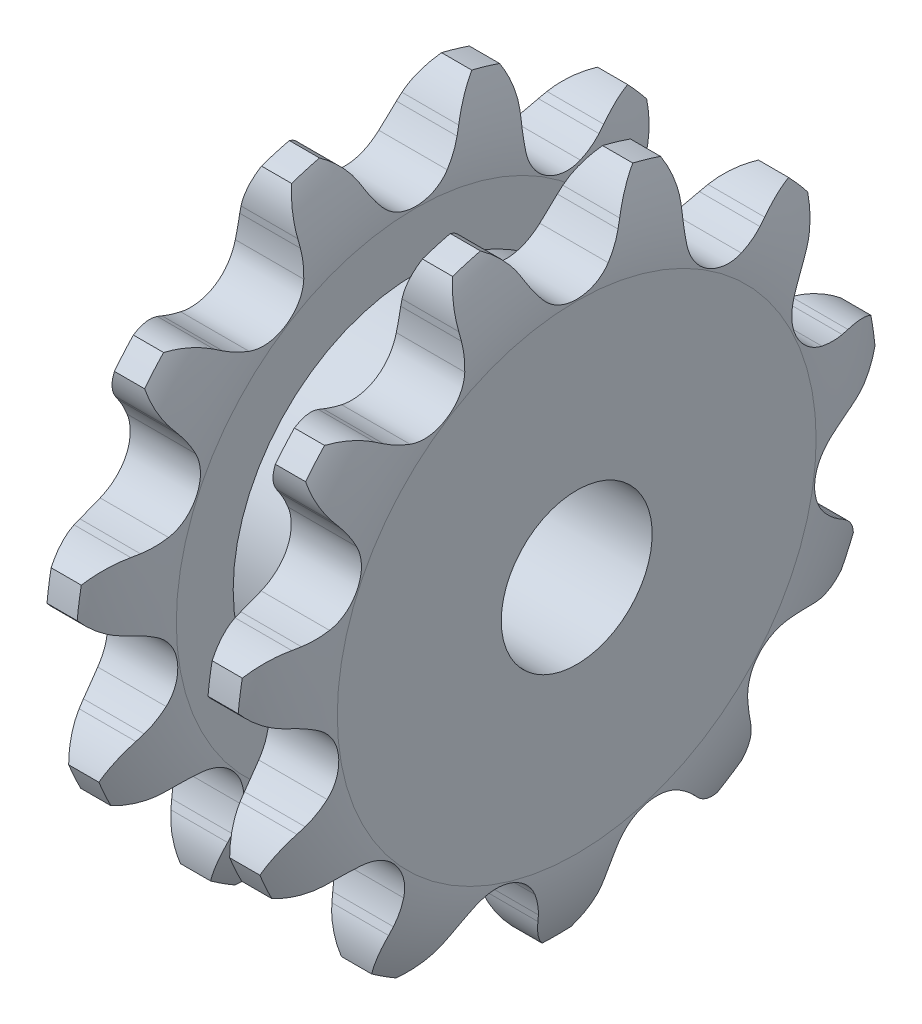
from build123d import *

# Parameters (mm, degrees)
TOOTHCUT_DEPTH  = 21.202424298
TEETHCUTS_COUNT = 11
TEETHCUTS_ANGLE = 327.272727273
BORSKE_R        = 3
BORE_DEPTH      = 95.0005


with BuildPart() as part:
    # BasProSke → Base-Revolve (revolve)
    with BuildSketch(Plane(origin=(0, 0, 0), x_dir=(1, 0, 0), z_dir=(0, 1, 0)), mode=Mode.PRIVATE) as base_revolve_sk:
        with BuildLine():
            Line((0, 0), (0, 9.518056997))
            ThreePointArc((0, 9.518056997), (0.203030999, 11.167299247), (0.8, 12.718056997))
            Line((0.8, 12.718056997), (8.4, 12.718056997))
            ThreePointArc((8.4, 12.718056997), (8.996969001, 11.167299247), (9.2, 9.518056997))
            Line((9.2, 9.518056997), (9.2, 0))
            Line((9.2, 0), (0, 0))
        make_face()
    revolve(base_revolve_sk.sketch.rotate(Axis((-10, 0, 0), (1, 0, 0)), 180), axis=Axis((-10, 0, 0), (1, 0, 0)))

    # GrvSke → Groove (revolve, cut)
    with BuildSketch(Plane(origin=(0, 0, 0), x_dir=(1, 0, 0), z_dir=(0, 1, 0)), mode=Mode.PRIVATE) as groove_sk:
        with BuildLine():
            Line((2.8, 9.518056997), (2.8, 7.257056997))
            Line((2.8, 7.257056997), (6.4, 7.257056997))
            Line((6.4, 7.257056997), (6.4, 9.518056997))
            ThreePointArc((6.4, 9.518056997), (6.603030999, 11.167299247), (7.2, 12.718056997))
            Line((7.2, 12.718056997), (2, 12.718056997))
            ThreePointArc((2, 12.718056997), (2.596969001, 11.167299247), (2.8, 9.518056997))
        make_face()
    revolve(groove_sk.sketch.rotate(Axis((0, 0, 0), (1, 0, 0)), 180), axis=Axis((0, 0, 0), (1, 0, 0)), mode=Mode.SUBTRACT)

    # TooCutSke → ToothCut (cut, through all)
    with BuildSketch(Plane(origin=(0, 0, 0), x_dir=(0, 0, -1), z_dir=(1, 0, 0))):
        with BuildLine():
            Line((1.837060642, 10.97698183), (1.978719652, 11.248579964))
            ThreePointArc((1.978719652, 11.248579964), (2.999002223, 12.336626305), (4.435544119, 12.738084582))
            ThreePointArc((4.435544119, 12.738084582), (0, 13.488248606), (-4.435544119, 12.738084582))
            ThreePointArc((-4.435544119, 12.738084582), (-2.999002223, 12.336626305), (-1.978719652, 11.248579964))
            Line((-1.978719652, 11.248579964), (-1.837060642, 10.97698183))
            ThreePointArc((-1.837060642, 10.97698183), (-1.587107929, 10.557228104), (-1.291552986, 10.16823347))
            ThreePointArc((-1.291552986, 10.16823347), (0, 9.572198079), (1.291552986, 10.16823347))
            ThreePointArc((1.291552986, 10.16823347), (1.587107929, 10.557228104), (1.837060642, 10.97698183))
        make_face()
    toothcut = extrude(amount=TOOTHCUT_DEPTH, mode=Mode.SUBTRACT)

    # TeethCuts: ToothCut ×11 about axis
    teethcuts_axis = Axis((-10, 0, 0), (1, 0, 0))
    for i in range(1, TEETHCUTS_COUNT):
        add(toothcut.rotate(teethcuts_axis, i * TEETHCUTS_ANGLE / (TEETHCUTS_COUNT - 1)), mode=Mode.SUBTRACT)

    # BorSke → Bore (cut, symmetric)
    with BuildSketch(Plane(origin=(0, 0, 0), x_dir=(0, 0, -1), z_dir=(1, 0, 0))):
        with Locations(Location((0, 0, 0), (0, 0, 180))):
            Circle(BORSKE_R)
    extrude(amount=BORE_DEPTH, both=True, mode=Mode.SUBTRACT)


solid = part.part
